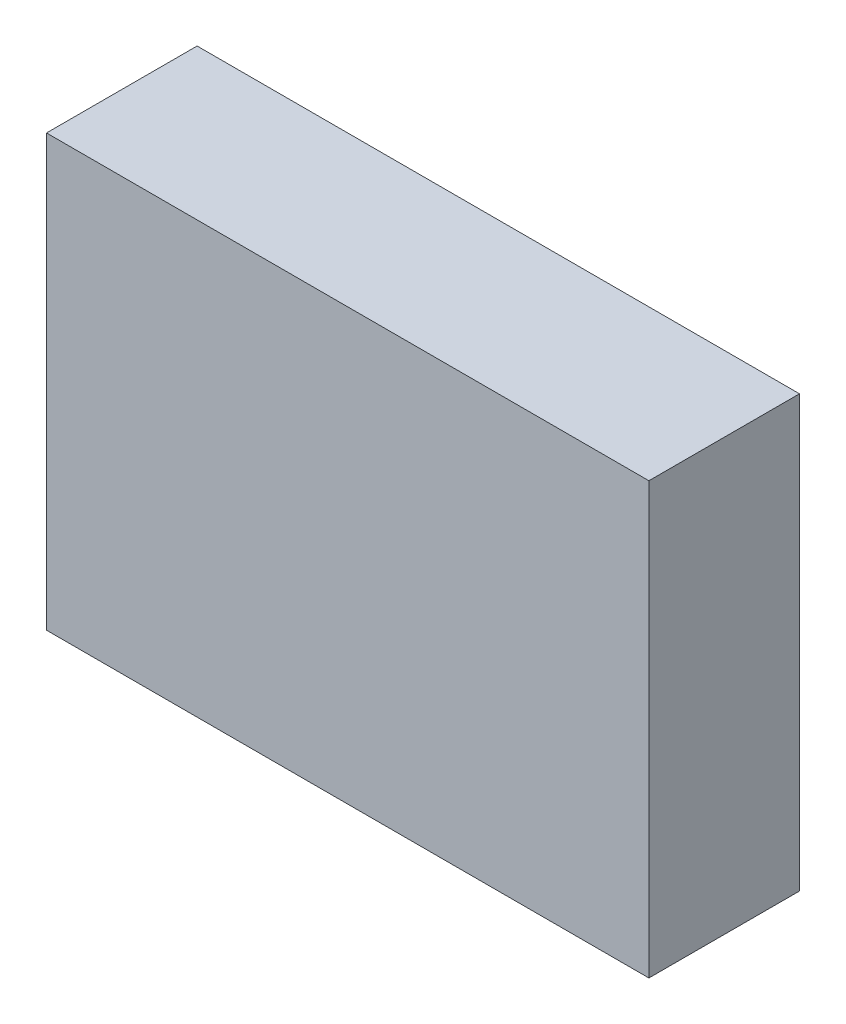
from build123d import *

# Parameters (mm, degrees)
ESQUISSE1_W          = 60
ESQUISSE1_H          = 42.893781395
BASE_EXTRUSION_DEPTH = 15


with BuildPart() as part:
    # Esquisse1 → Base-Extrusion (new body)
    with BuildSketch(Plane.XY):
        with Locations((-20, 771.053836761)):
            Rectangle(ESQUISSE1_W, ESQUISSE1_H)
    extrude(amount=BASE_EXTRUSION_DEPTH)


solid = part.part
